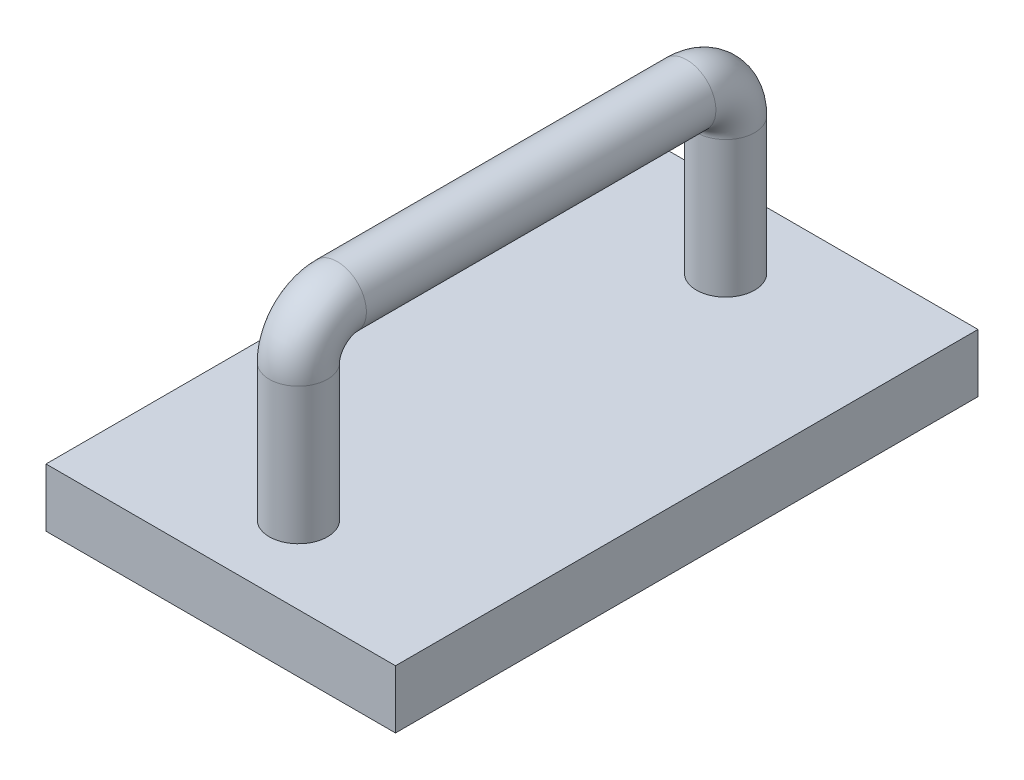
from build123d import *

# Parameters (mm, degrees)
CROQUIS1_W              = 90
CROQUIS1_H              = 150
SALIENTE_EXTRUIR1_DEPTH = 15
CROQUIS3_R              = 7.5


with BuildPart() as part:
    # Croquis1 → Saliente-Extruir1 (new body)
    with BuildSketch(Plane(origin=(0, 0, 0), x_dir=(1, 0, 0), z_dir=(0, 1, 0))):
        Rectangle(CROQUIS1_W, CROQUIS1_H)
    extrude(amount=SALIENTE_EXTRUIR1_DEPTH)

    # Barrer1: sweep along a path in Croquis2
    with BuildLine(Plane.ZY) as barrer1_path:
        Line((-55, 9.993307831), (-55, 50.13649865))
        ThreePointArc((-55, 50.13649865), (-52.071067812, 57.207566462), (-45, 60.13649865))
        Line((-45, 60.13649865), (45, 60.13649865))
        ThreePointArc((45, 60.13649865), (52.071067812, 57.207566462), (55, 50.13649865))
        Line((55, 50.13649865), (55, 9.993307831))
    # Croquis3 → Barrer1 (sweep)
    with BuildSketch(Plane(origin=(0, 15, 0), x_dir=(1, 0, 0), z_dir=(0, 1, 0))):
        with Locations((0, 55)):
            Circle(CROQUIS3_R)
    sweep(path=barrer1_path.line)


solid = part.part
